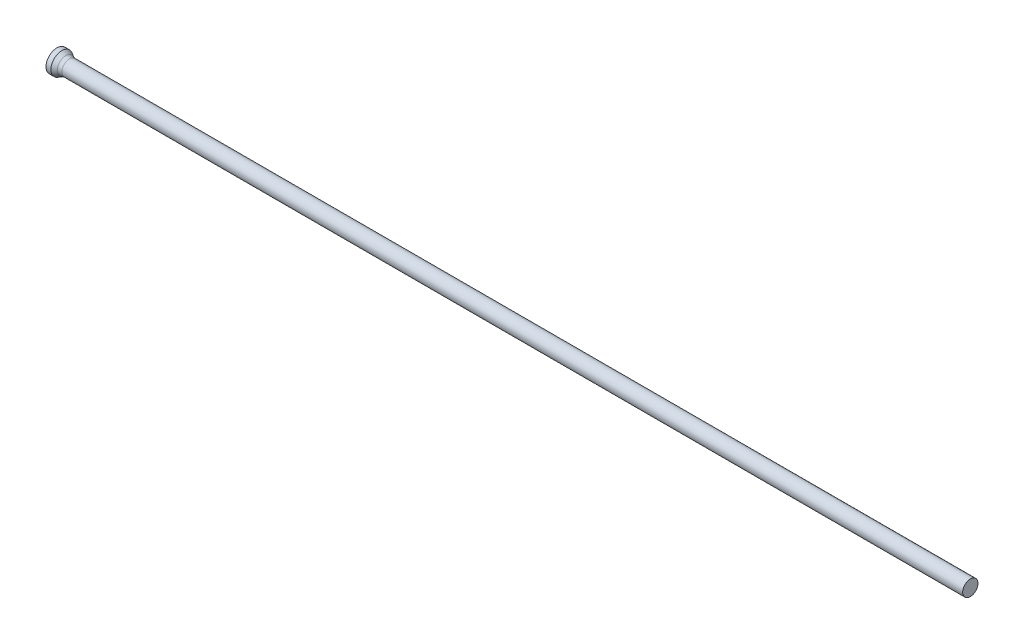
ISO-10303-21;
HEADER;
FILE_DESCRIPTION(('STEP AP214'),'2;1');
FILE_NAME('part.step','',(''),(''),'','','');
FILE_SCHEMA(('AUTOMOTIVE_DESIGN { 1 0 10303 214 1 1 1 1 }'));
ENDSEC;
DATA;
#1=APPLICATION_CONTEXT('core data for automotive mechanical design processes');
#2=APPLICATION_PROTOCOL_DEFINITION('international standard','automotive_design',2000,#1);
#3=PRODUCT_CONTEXT('',#1,'mechanical');
#4=PRODUCT('Part','Part','',(#3));
#5=PRODUCT_RELATED_PRODUCT_CATEGORY('part','',(#4));
#6=PRODUCT_DEFINITION_FORMATION('','',#4);
#7=PRODUCT_DEFINITION_CONTEXT('part definition',#1,'design');
#8=PRODUCT_DEFINITION('design','',#6,#7);
#9=PRODUCT_DEFINITION_SHAPE('','',#8);
#10=(LENGTH_UNIT() NAMED_UNIT(*) SI_UNIT(.MILLI.,.METRE.));
#11=(NAMED_UNIT(*) PLANE_ANGLE_UNIT() SI_UNIT($,.RADIAN.));
#12=(NAMED_UNIT(*) SI_UNIT($,.STERADIAN.) SOLID_ANGLE_UNIT());
#13=UNCERTAINTY_MEASURE_WITH_UNIT(LENGTH_MEASURE(1.E-05),#10,'distance_accuracy_value','');
#14=(GEOMETRIC_REPRESENTATION_CONTEXT(3) GLOBAL_UNCERTAINTY_ASSIGNED_CONTEXT((#13)) GLOBAL_UNIT_ASSIGNED_CONTEXT((#10,
#11,#12)) REPRESENTATION_CONTEXT('',''));
#15=CARTESIAN_POINT('',(0.,0.,0.));
#16=DIRECTION('',(0.,0.,1.));
#17=DIRECTION('',(1.,0.,0.));
#18=AXIS2_PLACEMENT_3D('',#15,#16,#17);
#19=CARTESIAN_POINT('',(0.,0.,0.));
#20=DIRECTION('',(1.,0.,0.));
#21=DIRECTION('',(0.,0.,-1.));
#22=AXIS2_PLACEMENT_3D('',#19,#20,#21);
#23=PLANE('',#22);
#24=CARTESIAN_POINT('',(0.,0.,0.));
#25=DIRECTION('',(-1.,0.,0.));
#26=DIRECTION('',(0.,0.,1.));
#27=AXIS2_PLACEMENT_3D('',#24,#25,#26);
#28=CIRCLE('',#27,1.5);
#29=CARTESIAN_POINT('',(0.,0.,1.5));
#30=VERTEX_POINT('',#29);
#31=EDGE_CURVE('E25',#30,#30,#28,.T.);
#32=ORIENTED_EDGE('',*,*,#31,.T.);
#33=EDGE_LOOP('',(#32));
#34=FACE_BOUND('',#33,.T.);
#35=ADVANCED_FACE('F14',(#34),#23,.F.);
#36=CARTESIAN_POINT('',(0.,0.,0.));
#37=DIRECTION('',(-1.,0.,0.));
#38=DIRECTION('',(0.,0.,1.));
#39=AXIS2_PLACEMENT_3D('',#36,#37,#38);
#40=CYLINDRICAL_SURFACE('',#39,1.5);
#41=ORIENTED_EDGE('',*,*,#31,.F.);
#42=EDGE_LOOP('',(#41));
#43=FACE_BOUND('',#42,.T.);
#44=CARTESIAN_POINT('',(0.670577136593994,0.,0.));
#45=DIRECTION('',(-1.,0.,0.));
#46=DIRECTION('',(0.,0.,1.));
#47=AXIS2_PLACEMENT_3D('',#44,#45,#46);
#48=CIRCLE('',#47,1.5);
#49=CARTESIAN_POINT('',(0.670577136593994,0.,1.5));
#50=VERTEX_POINT('',#49);
#51=EDGE_CURVE('E29',#50,#50,#48,.T.);
#52=ORIENTED_EDGE('',*,*,#51,.T.);
#53=EDGE_LOOP('',(#52));
#54=FACE_BOUND('',#53,.T.);
#55=ADVANCED_FACE('F53',(#43,#54),#40,.T.);
#56=CARTESIAN_POINT('',(1.45,0.,0.));
#57=DIRECTION('',(-1.,0.,0.));
#58=DIRECTION('',(0.,0.,1.));
#59=AXIS2_PLACEMENT_3D('',#56,#57,#58);
#60=CONICAL_SURFACE('',#59,1.05,0.523598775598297);
#61=CARTESIAN_POINT('',(1.21794919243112,0.,0.));
#62=DIRECTION('',(-1.,0.,0.));
#63=DIRECTION('',(0.,0.,1.));
#64=AXIS2_PLACEMENT_3D('',#61,#62,#63);
#65=CIRCLE('',#64,1.18397459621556);
#66=CARTESIAN_POINT('',(1.21794919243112,0.,1.18397459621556));
#67=VERTEX_POINT('',#66);
#68=EDGE_CURVE('E21',#67,#67,#65,.T.);
#69=ORIENTED_EDGE('',*,*,#68,.T.);
#70=EDGE_LOOP('',(#69));
#71=FACE_BOUND('',#70,.T.);
#72=ORIENTED_EDGE('',*,*,#51,.F.);
#73=EDGE_LOOP('',(#72));
#74=FACE_BOUND('',#73,.T.);
#75=ADVANCED_FACE('F50',(#71,#74),#60,.T.);
#76=CARTESIAN_POINT('',(0.,0.,0.));
#77=DIRECTION('',(-1.,0.,0.));
#78=DIRECTION('',(0.,0.,1.));
#79=AXIS2_PLACEMENT_3D('',#76,#77,#78);
#80=CYLINDRICAL_SURFACE('',#79,1.05);
#81=CARTESIAN_POINT('',(1.71794919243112,0.,0.));
#82=DIRECTION('',(-1.,0.,0.));
#83=DIRECTION('',(0.,0.,1.));
#84=AXIS2_PLACEMENT_3D('',#81,#82,#83);
#85=CIRCLE('',#84,1.05);
#86=CARTESIAN_POINT('',(1.71794919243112,0.,1.05));
#87=VERTEX_POINT('',#86);
#88=EDGE_CURVE('E9',#87,#87,#85,.F.);
#89=ORIENTED_EDGE('',*,*,#88,.T.);
#90=EDGE_LOOP('',(#89));
#91=FACE_BOUND('',#90,.T.);
#92=CARTESIAN_POINT('',(125.,0.,0.));
#93=DIRECTION('',(-1.,0.,0.));
#94=DIRECTION('',(0.,0.,1.));
#95=AXIS2_PLACEMENT_3D('',#92,#93,#94);
#96=CIRCLE('',#95,1.05);
#97=CARTESIAN_POINT('',(125.,0.,1.05));
#98=VERTEX_POINT('',#97);
#99=EDGE_CURVE('E34',#98,#98,#96,.T.);
#100=ORIENTED_EDGE('',*,*,#99,.T.);
#101=EDGE_LOOP('',(#100));
#102=FACE_BOUND('',#101,.T.);
#103=ADVANCED_FACE('F38',(#91,#102),#80,.T.);
#104=CARTESIAN_POINT('',(125.,1.05,0.));
#105=DIRECTION('',(-1.,0.,0.));
#106=DIRECTION('',(0.,0.,1.));
#107=AXIS2_PLACEMENT_3D('',#104,#105,#106);
#108=PLANE('',#107);
#109=ORIENTED_EDGE('',*,*,#99,.F.);
#110=EDGE_LOOP('',(#109));
#111=FACE_BOUND('',#110,.T.);
#112=ADVANCED_FACE('F40',(#111),#108,.F.);
#113=CARTESIAN_POINT('',(1.71794919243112,0.,0.));
#114=DIRECTION('',(-1.,0.,0.));
#115=DIRECTION('',(0.,0.,1.));
#116=AXIS2_PLACEMENT_3D('',#113,#114,#115);
#117=TOROIDAL_SURFACE('',#116,2.05,1.);
#118=ORIENTED_EDGE('',*,*,#88,.F.);
#119=EDGE_LOOP('',(#118));
#120=FACE_BOUND('',#119,.T.);
#121=ORIENTED_EDGE('',*,*,#68,.F.);
#122=EDGE_LOOP('',(#121));
#123=FACE_BOUND('',#122,.T.);
#124=ADVANCED_FACE('F16',(#120,#123),#117,.F.);
#125=CLOSED_SHELL('',(#35,#55,#75,#103,#112,#124));
#126=MANIFOLD_SOLID_BREP('B1',#125);
#127=ADVANCED_BREP_SHAPE_REPRESENTATION('',(#18,#126),#14);
#128=SHAPE_DEFINITION_REPRESENTATION(#9,#127);
ENDSEC;
END-ISO-10303-21;
